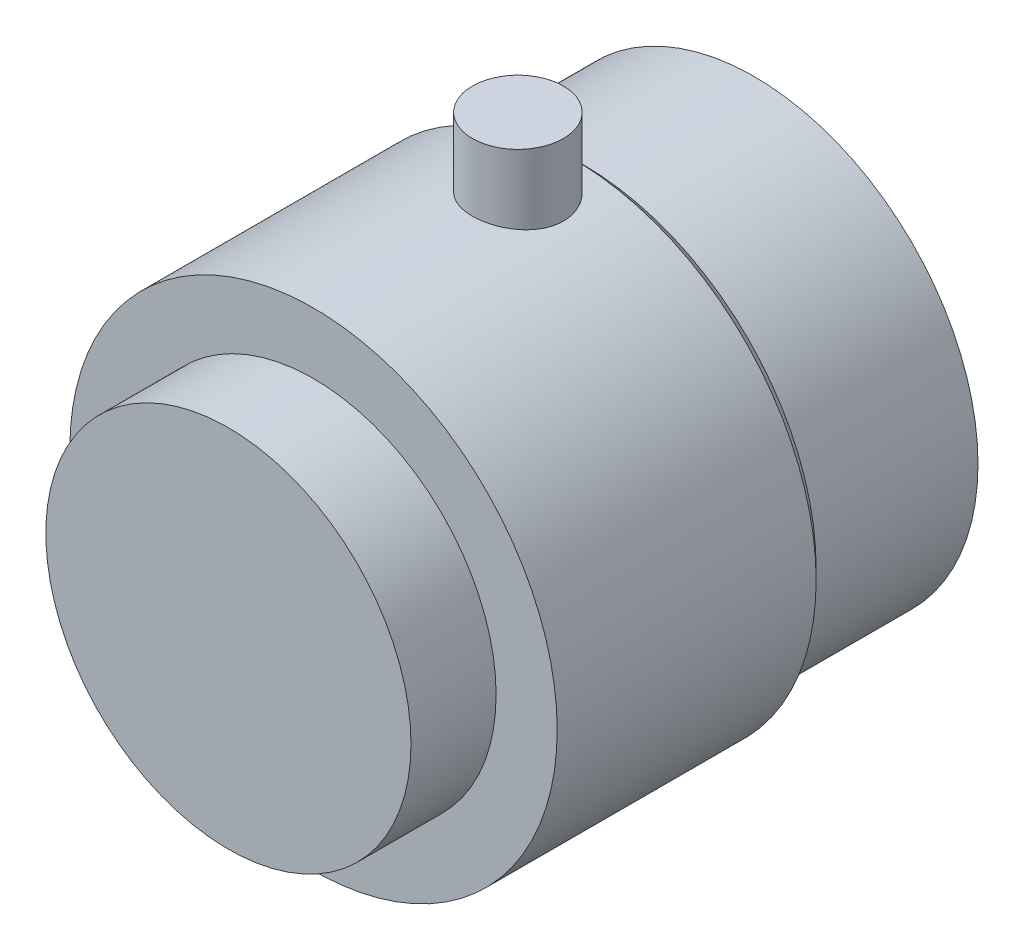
ISO-10303-21;
HEADER;
FILE_DESCRIPTION(('STEP AP214'),'2;1');
FILE_NAME('part.step','',(''),(''),'','','');
FILE_SCHEMA(('AUTOMOTIVE_DESIGN { 1 0 10303 214 1 1 1 1 }'));
ENDSEC;
DATA;
#1=APPLICATION_CONTEXT('core data for automotive mechanical design processes');
#2=APPLICATION_PROTOCOL_DEFINITION('international standard','automotive_design',2000,#1);
#3=PRODUCT_CONTEXT('',#1,'mechanical');
#4=PRODUCT('Part','Part','',(#3));
#5=PRODUCT_RELATED_PRODUCT_CATEGORY('part','',(#4));
#6=PRODUCT_DEFINITION_FORMATION('','',#4);
#7=PRODUCT_DEFINITION_CONTEXT('part definition',#1,'design');
#8=PRODUCT_DEFINITION('design','',#6,#7);
#9=PRODUCT_DEFINITION_SHAPE('','',#8);
#10=(LENGTH_UNIT() NAMED_UNIT(*) SI_UNIT(.MILLI.,.METRE.));
#11=(NAMED_UNIT(*) PLANE_ANGLE_UNIT() SI_UNIT($,.RADIAN.));
#12=(NAMED_UNIT(*) SI_UNIT($,.STERADIAN.) SOLID_ANGLE_UNIT());
#13=UNCERTAINTY_MEASURE_WITH_UNIT(LENGTH_MEASURE(1.E-05),#10,'distance_accuracy_value','');
#14=(GEOMETRIC_REPRESENTATION_CONTEXT(3) GLOBAL_UNCERTAINTY_ASSIGNED_CONTEXT((#13)) GLOBAL_UNIT_ASSIGNED_CONTEXT((#10,
#11,#12)) REPRESENTATION_CONTEXT('',''));
#15=CARTESIAN_POINT('',(0.,0.,0.));
#16=DIRECTION('',(0.,0.,1.));
#17=DIRECTION('',(1.,0.,0.));
#18=AXIS2_PLACEMENT_3D('',#15,#16,#17);
#19=CARTESIAN_POINT('',(0.,0.,30.7848));
#20=DIRECTION('',(0.,0.,-1.));
#21=DIRECTION('',(-1.,0.,0.));
#22=AXIS2_PLACEMENT_3D('',#19,#20,#21);
#23=CYLINDRICAL_SURFACE('',#22,17.018);
#24=CARTESIAN_POINT('',(0.,0.,12.7));
#25=DIRECTION('',(0.,0.,1.));
#26=DIRECTION('',(1.,0.,0.));
#27=AXIS2_PLACEMENT_3D('',#24,#25,#26);
#28=CIRCLE('',#27,17.018);
#29=CARTESIAN_POINT('',(17.018,0.,12.7));
#30=VERTEX_POINT('',#29);
#31=EDGE_CURVE('E39',#30,#30,#28,.T.);
#32=ORIENTED_EDGE('',*,*,#31,.T.);
#33=EDGE_LOOP('',(#32));
#34=FACE_BOUND('',#33,.T.);
#35=CARTESIAN_POINT('',(0.,0.,30.7848));
#36=DIRECTION('',(0.,0.,1.));
#37=DIRECTION('',(1.,0.,0.));
#38=AXIS2_PLACEMENT_3D('',#35,#36,#37);
#39=CIRCLE('',#38,17.018);
#40=CARTESIAN_POINT('',(17.018,0.,30.7848));
#41=VERTEX_POINT('',#40);
#42=EDGE_CURVE('E93',#41,#41,#39,.T.);
#43=ORIENTED_EDGE('',*,*,#42,.F.);
#44=EDGE_LOOP('',(#43));
#45=FACE_BOUND('',#44,.T.);
#46=CARTESIAN_POINT('',(0.,17.018,13.335));
#47=CARTESIAN_POINT('',(-0.1766981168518,17.0179968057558,13.3350067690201));
#48=CARTESIAN_POINT('',(-0.353484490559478,17.0152195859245,13.3498005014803));
#49=CARTESIAN_POINT('',(-0.702076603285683,17.0044083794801,13.4085470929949));
#50=CARTESIAN_POINT('',(-0.873877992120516,16.9963699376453,13.4525246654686));
#51=CARTESIAN_POINT('',(-1.20740822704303,16.975935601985,13.5682464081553));
#52=CARTESIAN_POINT('',(-1.36914597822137,16.9635436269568,13.6399656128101));
#53=CARTESIAN_POINT('',(-1.6782776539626,16.9357558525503,13.8090641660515));
#54=CARTESIAN_POINT('',(-1.82567276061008,16.920360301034,13.9064413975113));
#55=CARTESIAN_POINT('',(-2.10369871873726,16.8880608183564,14.1253181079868));
#56=CARTESIAN_POINT('',(-2.23413482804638,16.8711425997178,14.2470628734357));
#57=CARTESIAN_POINT('',(-2.47285559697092,16.8378107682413,14.5106911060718));
#58=CARTESIAN_POINT('',(-2.5811386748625,16.821397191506,14.6525760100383));
#59=CARTESIAN_POINT('',(-2.77328821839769,16.7907941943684,14.9538313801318));
#60=CARTESIAN_POINT('',(-2.85695684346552,16.7766231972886,15.1133300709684));
#61=CARTESIAN_POINT('',(-2.99623600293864,16.7523110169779,15.4444283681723));
#62=CARTESIAN_POINT('',(-3.05184893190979,16.7421694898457,15.6160269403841));
#63=CARTESIAN_POINT('',(-3.13281359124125,16.7272082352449,15.9643711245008));
#64=CARTESIAN_POINT('',(-3.15850478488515,16.722328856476,16.1410352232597));
#65=CARTESIAN_POINT('',(-3.17995031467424,16.7182644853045,16.4962286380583));
#66=CARTESIAN_POINT('',(-3.1757073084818,16.7190789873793,16.674757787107));
#67=CARTESIAN_POINT('',(-3.1376802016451,16.7262560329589,17.0261558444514));
#68=CARTESIAN_POINT('',(-3.10428189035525,16.7325461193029,17.1990681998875));
#69=CARTESIAN_POINT('',(-3.00949968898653,16.7498518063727,17.5367915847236));
#70=CARTESIAN_POINT('',(-2.94811462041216,16.7608676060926,17.7016022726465));
#71=CARTESIAN_POINT('',(-2.79872346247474,16.78645937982,18.0195739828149));
#72=CARTESIAN_POINT('',(-2.71056138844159,16.8010561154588,18.172659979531));
#73=CARTESIAN_POINT('',(-2.5102291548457,16.8321513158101,18.4620109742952));
#74=CARTESIAN_POINT('',(-2.3980565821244,16.8486499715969,18.5982742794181));
#75=CARTESIAN_POINT('',(-2.15080647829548,16.8820058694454,18.8523410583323));
#76=CARTESIAN_POINT('',(-2.01539892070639,16.8988646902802,18.969823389));
#77=CARTESIAN_POINT('',(-1.72662746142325,16.9308047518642,19.1804532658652));
#78=CARTESIAN_POINT('',(-1.57326338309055,16.9458859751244,19.2736005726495));
#79=CARTESIAN_POINT('',(-1.25259888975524,16.9726015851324,19.432962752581));
#80=CARTESIAN_POINT('',(-1.08528161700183,16.9842317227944,19.4991444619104));
#81=CARTESIAN_POINT('',(-0.741639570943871,17.0027018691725,19.6023733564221));
#82=CARTESIAN_POINT('',(-0.565315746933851,17.0095423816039,19.6394236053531));
#83=CARTESIAN_POINT('',(-0.211428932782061,17.0175934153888,19.6828914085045));
#84=CARTESIAN_POINT('',(-0.0339217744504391,17.0188848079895,19.689749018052));
#85=CARTESIAN_POINT('',(0.319702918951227,17.0159153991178,19.6738169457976));
#86=CARTESIAN_POINT('',(0.495820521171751,17.0116548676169,19.6510287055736));
#87=CARTESIAN_POINT('',(0.840272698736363,16.9981106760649,19.5768176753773));
#88=CARTESIAN_POINT('',(1.00865686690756,16.9888660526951,19.5256173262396));
#89=CARTESIAN_POINT('',(1.33445111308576,16.9663859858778,19.3962760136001));
#90=CARTESIAN_POINT('',(1.49186045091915,16.9531502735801,19.3181332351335));
#91=CARTESIAN_POINT('',(1.7931163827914,16.9239544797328,19.1361496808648));
#92=CARTESIAN_POINT('',(1.93679761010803,16.9079664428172,19.0320397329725));
#93=CARTESIAN_POINT('',(2.20480798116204,16.8751121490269,18.8014416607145));
#94=CARTESIAN_POINT('',(2.32913533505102,16.8582458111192,18.6749514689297));
#95=CARTESIAN_POINT('',(2.5565789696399,16.8252678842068,18.4011921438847));
#96=CARTESIAN_POINT('',(2.65939507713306,16.8091691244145,18.2536718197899));
#97=CARTESIAN_POINT('',(2.83878785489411,16.7798064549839,17.9431952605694));
#98=CARTESIAN_POINT('',(2.9153654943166,16.7665424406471,17.7802395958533));
#99=CARTESIAN_POINT('',(3.03968090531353,16.7444515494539,17.4442837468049));
#100=CARTESIAN_POINT('',(3.08755681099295,16.7356034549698,17.2713361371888));
#101=CARTESIAN_POINT('',(3.15353616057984,16.7232975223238,16.9196713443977));
#102=CARTESIAN_POINT('',(3.17164292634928,16.7198390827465,16.7409548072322));
#103=CARTESIAN_POINT('',(3.17745972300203,16.7187343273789,16.3858315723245));
#104=CARTESIAN_POINT('',(3.16564319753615,16.7209974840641,16.2094327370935));
#105=CARTESIAN_POINT('',(3.1129847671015,16.7308802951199,15.8611827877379));
#106=CARTESIAN_POINT('',(3.07214303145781,16.7384999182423,15.6893316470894));
#107=CARTESIAN_POINT('',(2.96279243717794,16.7581991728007,15.3553066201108));
#108=CARTESIAN_POINT('',(2.89433435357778,16.7702706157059,15.193115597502));
#109=CARTESIAN_POINT('',(2.73174596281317,16.797519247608,14.8824455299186));
#110=CARTESIAN_POINT('',(2.63761386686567,16.8126966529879,14.7339674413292));
#111=CARTESIAN_POINT('',(2.42470148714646,16.8447283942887,14.4525654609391));
#112=CARTESIAN_POINT('',(2.30557646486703,16.8616042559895,14.3199048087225));
#113=CARTESIAN_POINT('',(2.04677900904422,16.8949698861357,14.0762978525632));
#114=CARTESIAN_POINT('',(1.90710186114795,16.9114595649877,13.9653565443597));
#115=CARTESIAN_POINT('',(1.60967615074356,16.9423669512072,13.7674159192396));
#116=CARTESIAN_POINT('',(1.45177780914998,16.9567649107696,13.6806384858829));
#117=CARTESIAN_POINT('',(1.12342580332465,16.9816738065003,13.5349815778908));
#118=CARTESIAN_POINT('',(0.952984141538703,16.9921884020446,13.4760758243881));
#119=CARTESIAN_POINT('',(0.651694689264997,17.0059950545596,13.3998338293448));
#120=CARTESIAN_POINT('',(0.522611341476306,17.0104715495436,13.3755625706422));
#121=CARTESIAN_POINT('',(0.262368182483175,17.0164751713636,13.3431433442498));
#122=CARTESIAN_POINT('',(0.131208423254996,17.0180023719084,13.3349949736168));
#123=CARTESIAN_POINT('',(0.,17.018,13.335));
#124=B_SPLINE_CURVE_WITH_KNOTS('',3,(#46,#47,#48,#49,#50,#51,#52,#53,#54,#55,#56,#57,#58,#59,
#60,#61,#62,#63,#64,#65,#66,#67,#68,#69,#70,#71,#72,#73,#74,#75,#76,#77,#78,#79,#80,#81,#82,#83,
#84,#85,#86,#87,#88,#89,#90,#91,#92,#93,#94,#95,#96,#97,#98,#99,#100,#101,#102,#103,#104,#105,
#106,#107,#108,#109,#110,#111,#112,#113,#114,#115,#116,#117,#118,#119,#120,#121,#122,#123),
.UNSPECIFIED.,.T.,.F.,(4,2,2,2,2,2,2,2,2,2,2,2,2,2,2,2,2,2,2,2,2,2,2,2,2,2,2,2,2,2,2,2,2,2,2,2,
2,2,4),(0.,0.529614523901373,1.05967810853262,1.58926577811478,2.11880976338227,
2.65397968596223,3.18918780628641,3.72858701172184,4.26794017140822,4.80111283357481,
5.33423815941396,5.86041419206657,6.386612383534,6.91593663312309,7.44531410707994,
7.98295007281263,8.52059132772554,9.05889182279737,9.59713569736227,10.1275081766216,
10.6578548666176,11.184106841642,11.7103942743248,12.2423820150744,12.7744189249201,
13.3134466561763,13.852454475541,14.3888469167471,14.925179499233,15.4530794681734,
15.9809763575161,16.507907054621,17.0348744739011,17.5696546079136,18.1045576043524,
18.6442214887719,19.1833755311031,19.5766543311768,19.9699233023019),.UNSPECIFIED.);
#125=CARTESIAN_POINT('',(0.,17.018,13.335));
#126=VERTEX_POINT('',#125);
#127=EDGE_CURVE('E43',#126,#126,#124,.T.);
#128=ORIENTED_EDGE('',*,*,#127,.F.);
#129=EDGE_LOOP('',(#128));
#130=FACE_BOUND('',#129,.T.);
#131=ADVANCED_FACE('F32',(#34,#45,#130),#23,.T.);
#132=CARTESIAN_POINT('',(0.,0.,30.7848));
#133=DIRECTION('',(0.,0.,1.));
#134=DIRECTION('',(1.,0.,0.));
#135=AXIS2_PLACEMENT_3D('',#132,#133,#134);
#136=PLANE('',#135);
#137=ORIENTED_EDGE('',*,*,#42,.T.);
#138=EDGE_LOOP('',(#137));
#139=FACE_BOUND('',#138,.T.);
#140=CARTESIAN_POINT('',(0.,0.,30.7848));
#141=DIRECTION('',(0.,0.,1.));
#142=DIRECTION('',(1.,0.,0.));
#143=AXIS2_PLACEMENT_3D('',#140,#141,#142);
#144=CIRCLE('',#143,12.7508);
#145=CARTESIAN_POINT('',(12.7508,0.,30.7848));
#146=VERTEX_POINT('',#145);
#147=EDGE_CURVE('E100',#146,#146,#144,.T.);
#148=ORIENTED_EDGE('',*,*,#147,.F.);
#149=EDGE_LOOP('',(#148));
#150=FACE_BOUND('',#149,.T.);
#151=ADVANCED_FACE('F75',(#139,#150),#136,.T.);
#152=CARTESIAN_POINT('',(0.,0.,11.938));
#153=DIRECTION('',(0.,0.,-1.));
#154=DIRECTION('',(-1.,0.,0.));
#155=AXIS2_PLACEMENT_3D('',#152,#153,#154);
#156=CYLINDRICAL_SURFACE('',#155,15.621);
#157=CARTESIAN_POINT('',(0.,0.,11.938));
#158=DIRECTION('',(0.,0.,1.));
#159=DIRECTION('',(1.,0.,0.));
#160=AXIS2_PLACEMENT_3D('',#157,#158,#159);
#161=CIRCLE('',#160,15.621);
#162=CARTESIAN_POINT('',(15.621,0.,11.938));
#163=VERTEX_POINT('',#162);
#164=EDGE_CURVE('E47',#163,#163,#161,.T.);
#165=ORIENTED_EDGE('',*,*,#164,.F.);
#166=EDGE_LOOP('',(#165));
#167=FACE_BOUND('',#166,.T.);
#168=CARTESIAN_POINT('',(0.,0.,0.));
#169=DIRECTION('',(0.,0.,1.));
#170=DIRECTION('',(1.,0.,0.));
#171=AXIS2_PLACEMENT_3D('',#168,#169,#170);
#172=CIRCLE('',#171,15.621);
#173=CARTESIAN_POINT('',(15.621,0.,0.));
#174=VERTEX_POINT('',#173);
#175=EDGE_CURVE('E54',#174,#174,#172,.T.);
#176=ORIENTED_EDGE('',*,*,#175,.T.);
#177=EDGE_LOOP('',(#176));
#178=FACE_BOUND('',#177,.T.);
#179=ADVANCED_FACE('F77',(#167,#178),#156,.T.);
#180=CARTESIAN_POINT('',(0.,0.,0.));
#181=DIRECTION('',(0.,0.,1.));
#182=DIRECTION('',(1.,0.,0.));
#183=AXIS2_PLACEMENT_3D('',#180,#181,#182);
#184=PLANE('',#183);
#185=ORIENTED_EDGE('',*,*,#175,.F.);
#186=EDGE_LOOP('',(#185));
#187=FACE_BOUND('',#186,.T.);
#188=ADVANCED_FACE('F80',(#187),#184,.F.);
#189=CARTESIAN_POINT('',(0.,0.,11.938));
#190=DIRECTION('',(0.,0.,1.));
#191=DIRECTION('',(1.,0.,0.));
#192=AXIS2_PLACEMENT_3D('',#189,#190,#191);
#193=PLANE('',#192);
#194=CARTESIAN_POINT('',(0.,0.,11.938));
#195=DIRECTION('',(0.,0.,1.));
#196=DIRECTION('',(1.,0.,0.));
#197=AXIS2_PLACEMENT_3D('',#194,#195,#196);
#198=CIRCLE('',#197,16.256);
#199=CARTESIAN_POINT('',(16.256,0.,11.938));
#200=VERTEX_POINT('',#199);
#201=EDGE_CURVE('E10',#200,#200,#198,.F.);
#202=ORIENTED_EDGE('',*,*,#201,.T.);
#203=EDGE_LOOP('',(#202));
#204=FACE_BOUND('',#203,.T.);
#205=ORIENTED_EDGE('',*,*,#164,.T.);
#206=EDGE_LOOP('',(#205));
#207=FACE_BOUND('',#206,.T.);
#208=ADVANCED_FACE('F73',(#204,#207),#193,.F.);
#209=CARTESIAN_POINT('',(0.,0.,36.7284));
#210=DIRECTION('',(0.,0.,-1.));
#211=DIRECTION('',(-1.,0.,0.));
#212=AXIS2_PLACEMENT_3D('',#209,#210,#211);
#213=CYLINDRICAL_SURFACE('',#212,12.7508);
#214=CARTESIAN_POINT('',(0.,0.,36.7284));
#215=DIRECTION('',(0.,0.,1.));
#216=DIRECTION('',(1.,0.,0.));
#217=AXIS2_PLACEMENT_3D('',#214,#215,#216);
#218=CIRCLE('',#217,12.7508);
#219=CARTESIAN_POINT('',(12.7508,0.,36.7284));
#220=VERTEX_POINT('',#219);
#221=EDGE_CURVE('E96',#220,#220,#218,.T.);
#222=ORIENTED_EDGE('',*,*,#221,.F.);
#223=EDGE_LOOP('',(#222));
#224=FACE_BOUND('',#223,.T.);
#225=ORIENTED_EDGE('',*,*,#147,.T.);
#226=EDGE_LOOP('',(#225));
#227=FACE_BOUND('',#226,.T.);
#228=ADVANCED_FACE('F69',(#224,#227),#213,.T.);
#229=CARTESIAN_POINT('',(0.,0.,36.7284));
#230=DIRECTION('',(0.,0.,1.));
#231=DIRECTION('',(1.,0.,0.));
#232=AXIS2_PLACEMENT_3D('',#229,#230,#231);
#233=PLANE('',#232);
#234=ORIENTED_EDGE('',*,*,#221,.T.);
#235=EDGE_LOOP('',(#234));
#236=FACE_BOUND('',#235,.T.);
#237=ADVANCED_FACE('F65',(#236),#233,.T.);
#238=CARTESIAN_POINT('',(0.,21.717,16.51));
#239=DIRECTION('',(0.,-1.,0.));
#240=DIRECTION('',(0.,0.,-1.));
#241=AXIS2_PLACEMENT_3D('',#238,#239,#240);
#242=CYLINDRICAL_SURFACE('',#241,3.175);
#243=CARTESIAN_POINT('',(0.,21.717,16.51));
#244=DIRECTION('',(0.,1.,0.));
#245=DIRECTION('',(0.,0.,1.));
#246=AXIS2_PLACEMENT_3D('',#243,#244,#245);
#247=CIRCLE('',#246,3.175);
#248=CARTESIAN_POINT('',(0.,21.717,19.685));
#249=VERTEX_POINT('',#248);
#250=EDGE_CURVE('E170',#249,#249,#247,.T.);
#251=ORIENTED_EDGE('',*,*,#250,.F.);
#252=EDGE_LOOP('',(#251));
#253=FACE_BOUND('',#252,.T.);
#254=ORIENTED_EDGE('',*,*,#127,.T.);
#255=EDGE_LOOP('',(#254));
#256=FACE_BOUND('',#255,.T.);
#257=ADVANCED_FACE('F59',(#253,#256),#242,.T.);
#258=CARTESIAN_POINT('',(0.,21.717,16.51));
#259=DIRECTION('',(0.,1.,0.));
#260=DIRECTION('',(0.,0.,1.));
#261=AXIS2_PLACEMENT_3D('',#258,#259,#260);
#262=PLANE('',#261);
#263=ORIENTED_EDGE('',*,*,#250,.T.);
#264=EDGE_LOOP('',(#263));
#265=FACE_BOUND('',#264,.T.);
#266=ADVANCED_FACE('F64',(#265),#262,.T.);
#267=CARTESIAN_POINT('',(0.,0.,12.7));
#268=DIRECTION('',(0.,0.,1.));
#269=DIRECTION('',(1.,0.,0.));
#270=AXIS2_PLACEMENT_3D('',#267,#268,#269);
#271=CONICAL_SURFACE('',#270,17.018,0.785398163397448);
#272=ORIENTED_EDGE('',*,*,#201,.F.);
#273=EDGE_LOOP('',(#272));
#274=FACE_BOUND('',#273,.T.);
#275=ORIENTED_EDGE('',*,*,#31,.F.);
#276=EDGE_LOOP('',(#275));
#277=FACE_BOUND('',#276,.T.);
#278=ADVANCED_FACE('F34',(#274,#277),#271,.T.);
#279=CLOSED_SHELL('',(#131,#151,#179,#188,#208,#228,#237,#257,#266,#278));
#280=MANIFOLD_SOLID_BREP('B2',#279);
#281=ADVANCED_BREP_SHAPE_REPRESENTATION('',(#18,#280),#14);
#282=SHAPE_DEFINITION_REPRESENTATION(#9,#281);
ENDSEC;
END-ISO-10303-21;
